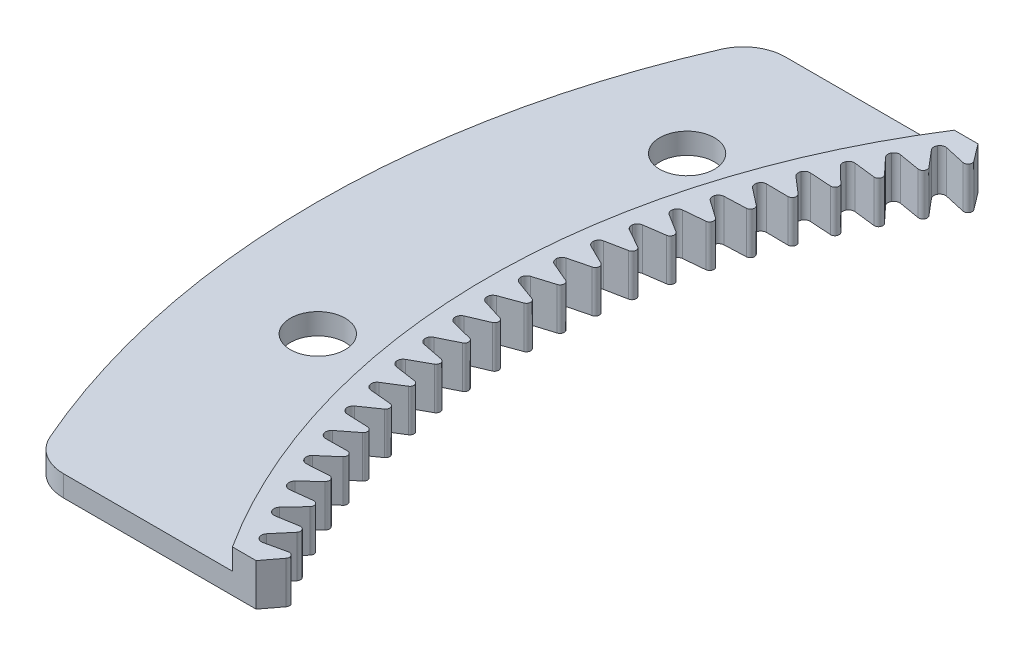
from build123d import *

# Parameters (mm, degrees)
SALIENTE_EXTRUIR1_DEPTH = 10
SALIENTE_EXTRUIR3_DEPTH = 5
REDONDEO1_R             = 10
REDONDEO2_R             = 10
CROQUIS5_R              = 6.5
CORTAR_EXTRUIR1_DEPTH   = 5
CROQUIS6_R              = 6.5
CORTAR_EXTRUIR2_DEPTH   = 5


with BuildPart() as part:
    # Croquis1 → Saliente-Extruir1 (new body)
    with BuildSketch(Plane(origin=(0, 0, 0), x_dir=(1, 0, 0), z_dir=(0, 1, 0))):
        with BuildLine():
            Line((-149.655811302, 0.938965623), (-154.427708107, 2.687256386))
            ThreePointArc((-154.427708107, 2.687256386), (-154.720139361, 2.83546584), (-154.969852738, 3.047893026))
            ThreePointArc((-154.969852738, 3.047893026), (-155.252418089, 3.504537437), (-155.341335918, 4.034123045))
            ThreePointArc((-155.341335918, 4.034123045), (-155.059296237, 4.841235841), (-154.359032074, 5.331753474))
            Line((-154.359032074, 5.331753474), (-149.502824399, 6.830008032))
            ThreePointArc((-149.502824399, 6.830008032), (-148.798983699, 7.733659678), (-149.405352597, 8.705407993))
            Line((-149.405352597, 8.705407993), (-154.080074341, 10.699021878))
            ThreePointArc((-154.080074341, 10.699021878), (-154.725714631, 11.25949138), (-154.92256314, 12.091493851))
            ThreePointArc((-154.92256314, 12.091493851), (-154.599011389, 12.882879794), (-153.874231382, 13.33638987))
            Line((-153.874231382, 13.33638987), (-148.946804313, 14.580569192))
            ThreePointArc((-148.946804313, 14.580569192), (-148.197009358, 15.446470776), (-148.752123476, 16.448382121))
            Line((-148.752123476, 16.448382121), (-153.317067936, 18.681944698))
            ThreePointArc((-153.317067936, 18.681944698), (-153.932747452, 19.275169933), (-154.086146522, 20.116268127))
            ThreePointArc((-154.086146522, 20.116268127), (-153.721954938, 20.889793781), (-152.974612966, 21.305073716))
            Line((-152.974612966, 21.305073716), (-147.989249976, 22.291823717))
            ThreePointArc((-147.989249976, 22.291823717), (-147.19552208, 23.117640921), (-147.697884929, 24.14701432))
            Line((-147.697884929, 24.14701432), (-152.140745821, 26.614504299))
            ThreePointArc((-152.140745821, 26.614504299), (-152.724804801, 27.238886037), (-152.834340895, 28.086812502))
            ThreePointArc((-152.834340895, 28.086812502), (-152.430491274, 28.840392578), (-151.662602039, 29.21632285))
            Line((-151.662602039, 29.21632285), (-146.632742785, 29.942983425))
            ThreePointArc((-146.632742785, 29.942983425), (-145.797221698, 30.726489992), (-146.245478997, 31.780550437))
            Line((-146.245478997, 31.780550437), (-150.554279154, 34.475315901))
            ThreePointArc((-150.554279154, 34.475315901), (-151.105143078, 35.129170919), (-151.170520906, 35.981639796))
            ThreePointArc((-151.170520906, 35.981639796), (-150.728101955, 36.713242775), (-149.94173555, 37.048809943))
            Line((-149.94173555, 37.048809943), (-144.880939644, 37.513422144))
            ThreePointArc((-144.880939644, 37.513422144), (-144.005877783, 38.252505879), (-144.398821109, 39.328411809))
            Line((-144.398821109, 39.328411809), (-148.561944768, 42.243188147))
            ThreePointArc((-148.561944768, 42.243188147), (-149.078128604, 42.924753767), (-149.099171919, 43.77946695))
            ThreePointArc((-149.099171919, 43.77946695), (-148.619376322, 44.487120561), (-147.816652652, 44.781419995))
            Line((-147.816652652, 44.781419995), (-142.738563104, 44.982731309))
            ThreePointArc((-142.738563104, 44.982731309), (-141.826319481, 45.675399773), (-142.162889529, 46.770250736))
            Line((-142.162889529, 46.770250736), (-146.169113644, 49.897180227))
            ThreePointArc((-146.169113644, 49.897180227), (-146.649225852, 50.604619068), (-146.625877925, 51.459272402))
            ThreePointArc((-146.625877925, 51.459272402), (-146.109999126, 52.141068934), (-145.293082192, 52.393307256))
            Line((-145.293082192, 52.393307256), (-140.211388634, 52.330774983))
            ThreePointArc((-140.211388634, 52.330774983), (-139.264422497, 52.975160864), (-139.543711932, 54.086005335))
            Line((-139.543711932, 54.086005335), (-143.382236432, 57.41665833))
            ThreePointArc((-143.382236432, 57.41665833), (-143.824982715, 58.148063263), (-143.757306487, 59.000352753))
            ThreePointArc((-143.757306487, 59.000352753), (-143.206735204, 59.654454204), (-142.37782727, 59.863951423))
            Line((-142.37782727, 59.863951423), (-137.306229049, 59.53774414))
            ThreePointArc((-137.306229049, 59.53774414), (-136.327093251, 60.132110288), (-136.54834916, 61.255953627))
            Line((-136.54834916, 61.255953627), (-140.208826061, 64.781351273))
            ThreePointArc((-140.208826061, 64.781351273), (-140.613012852, 65.534750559), (-140.501190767, 66.382378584))
            ThreePointArc((-140.501190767, 66.382378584), (-139.917411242, 67.007021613), (-139.078746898, 67.173212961))
            Line((-139.078746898, 67.173212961), (-134.030916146, 66.584210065))
            ThreePointArc((-134.030916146, 66.584210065), (-133.022250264, 67.126954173), (-133.184876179, 68.260766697))
            Line((-133.184876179, 68.260766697), (-136.657437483, 71.971405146))
            ThreePointArc((-136.657437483, 71.971405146), (-137.021975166, 72.744767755), (-136.866308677, 73.585449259))
            ThreePointArc((-136.866308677, 73.585449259), (-136.250894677, 74.178949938), (-135.404734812, 74.301387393))
            Line((-135.404734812, 74.301387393), (-130.39427959, 73.451176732))
            ThreePointArc((-130.39427959, 73.451176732), (-129.358802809, 73.940835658), (-129.462360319, 75.081560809))
            Line((-129.462360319, 75.081560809), (-132.737644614, 78.967436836))
            ThreePointArc((-132.737644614, 78.967436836), (-133.061550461, 79.758677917), (-132.862459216, 80.590146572))
            ThreePointArc((-132.862459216, 80.590146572), (-132.217069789, 81.150904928), (-131.365695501, 81.229258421))
            Line((-131.365695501, 81.229258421), (-126.406123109, 80.120132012))
            ThreePointArc((-126.406123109, 80.120132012), (-125.346626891, 80.555385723), (-125.390836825, 81.699948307))
            Line((-125.390836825, 81.699948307), (-128.460014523, 85.750586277))
            Line((-128.460014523, 85.750586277), (-134.088577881, 85.750586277))
            ThreePointArc((-134.088577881, 85.750586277), (-159.163154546, 0), (-134.088577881, -85.750586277))
            Line((-134.088577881, -85.750586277), (-128.460014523, -85.750586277))
            Line((-128.460014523, -85.750586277), (-125.390836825, -81.699948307))
            ThreePointArc((-125.390836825, -81.699948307), (-125.346626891, -80.555385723), (-126.406123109, -80.120132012))
            Line((-126.406123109, -80.120132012), (-131.365695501, -81.229258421))
            ThreePointArc((-131.365695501, -81.229258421), (-132.217069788, -81.150904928), (-132.862459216, -80.590146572))
            ThreePointArc((-132.862459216, -80.590146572), (-133.061550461, -79.758677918), (-132.737644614, -78.967436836))
            Line((-132.737644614, -78.967436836), (-129.462360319, -75.081560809))
            ThreePointArc((-129.462360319, -75.081560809), (-129.358802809, -73.940835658), (-130.39427959, -73.451176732))
            Line((-130.39427959, -73.451176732), (-135.404734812, -74.301387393))
            ThreePointArc((-135.404734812, -74.301387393), (-136.250894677, -74.178949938), (-136.866308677, -73.585449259))
            ThreePointArc((-136.866308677, -73.585449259), (-137.021975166, -72.744767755), (-136.657437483, -71.971405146))
            Line((-136.657437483, -71.971405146), (-133.184876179, -68.260766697))
            ThreePointArc((-133.184876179, -68.260766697), (-133.022250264, -67.126954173), (-134.030916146, -66.584210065))
            Line((-134.030916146, -66.584210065), (-139.078746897, -67.173212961))
            ThreePointArc((-139.078746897, -67.173212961), (-139.917411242, -67.007021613), (-140.501190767, -66.382378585))
            ThreePointArc((-140.501190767, -66.382378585), (-140.613012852, -65.53475056), (-140.208826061, -64.781351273))
            Line((-140.208826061, -64.781351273), (-136.54834916, -61.255953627))
            ThreePointArc((-136.54834916, -61.255953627), (-136.327093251, -60.132110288), (-137.306229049, -59.53774414))
            Line((-137.306229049, -59.53774414), (-142.37782727, -59.863951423))
            ThreePointArc((-142.37782727, -59.863951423), (-143.206735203, -59.654454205), (-143.757306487, -59.000352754))
            ThreePointArc((-143.757306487, -59.000352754), (-143.824982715, -58.148063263), (-143.382236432, -57.41665833))
            Line((-143.382236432, -57.41665833), (-139.543711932, -54.086005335))
            ThreePointArc((-139.543711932, -54.086005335), (-139.264422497, -52.975160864), (-140.211388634, -52.330774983))
            Line((-140.211388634, -52.330774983), (-145.293082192, -52.393307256))
            ThreePointArc((-145.293082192, -52.393307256), (-146.109999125, -52.141068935), (-146.625877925, -51.459272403))
            ThreePointArc((-146.625877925, -51.459272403), (-146.649225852, -50.604619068), (-146.169113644, -49.897180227))
            Line((-146.169113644, -49.897180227), (-142.162889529, -46.770250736))
            ThreePointArc((-142.162889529, -46.770250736), (-141.826319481, -45.675399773), (-142.738563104, -44.982731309))
            Line((-142.738563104, -44.982731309), (-147.816652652, -44.781419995))
            ThreePointArc((-147.816652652, -44.781419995), (-148.619376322, -44.487120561), (-149.099171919, -43.779466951))
            ThreePointArc((-149.099171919, -43.779466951), (-149.078128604, -42.924753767), (-148.561944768, -42.243188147))
            Line((-148.561944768, -42.243188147), (-144.398821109, -39.328411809))
            ThreePointArc((-144.398821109, -39.328411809), (-144.005877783, -38.252505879), (-144.880939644, -37.513422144))
            Line((-144.880939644, -37.513422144), (-149.94173555, -37.048809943))
            ThreePointArc((-149.94173555, -37.048809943), (-150.728101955, -36.713242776), (-151.170520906, -35.981639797))
            ThreePointArc((-151.170520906, -35.981639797), (-151.105143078, -35.129170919), (-150.554279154, -34.475315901))
            Line((-150.554279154, -34.475315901), (-146.245478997, -31.780550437))
            ThreePointArc((-146.245478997, -31.780550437), (-145.797221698, -30.726489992), (-146.632742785, -29.942983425))
            Line((-146.632742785, -29.942983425), (-151.662602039, -29.21632285))
            ThreePointArc((-151.662602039, -29.21632285), (-152.430491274, -28.840392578), (-152.834340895, -28.086812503))
            ThreePointArc((-152.834340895, -28.086812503), (-152.724804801, -27.238886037), (-152.140745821, -26.614504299))
            Line((-152.140745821, -26.614504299), (-147.697884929, -24.14701432))
            ThreePointArc((-147.697884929, -24.14701432), (-147.19552208, -23.117640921), (-147.989249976, -22.291823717))
            Line((-147.989249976, -22.291823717), (-152.974612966, -21.305073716))
            ThreePointArc((-152.974612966, -21.305073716), (-153.721954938, -20.889793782), (-154.086146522, -20.116268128))
            ThreePointArc((-154.086146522, -20.116268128), (-153.932747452, -19.275169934), (-153.317067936, -18.681944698))
            Line((-153.317067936, -18.681944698), (-148.752123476, -16.448382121))
            ThreePointArc((-148.752123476, -16.448382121), (-148.197009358, -15.446470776), (-148.946804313, -14.580569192))
            Line((-148.946804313, -14.580569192), (-153.874231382, -13.33638987))
            ThreePointArc((-153.874231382, -13.33638987), (-154.599011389, -12.882879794), (-154.92256314, -12.091493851))
            ThreePointArc((-154.92256314, -12.091493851), (-154.725714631, -11.25949138), (-154.080074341, -10.699021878))
            Line((-154.080074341, -10.699021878), (-149.405352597, -8.705407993))
            ThreePointArc((-149.405352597, -8.705407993), (-148.798983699, -7.733659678), (-149.502824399, -6.830008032))
            Line((-149.502824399, -6.830008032), (-154.359032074, -5.331753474))
            ThreePointArc((-154.359032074, -5.331753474), (-155.059296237, -4.841235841), (-155.341335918, -4.034123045))
            ThreePointArc((-155.341335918, -4.034123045), (-155.101568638, -3.213459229), (-154.427708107, -2.687256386))
            Line((-154.427708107, -2.687256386), (-149.655811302, -0.938965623))
            ThreePointArc((-149.655811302, -0.938965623), (-148.999822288, 0), (-149.655811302, 0.938965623))
        make_face()
    extrude(amount=SALIENTE_EXTRUIR1_DEPTH)

    # Croquis4 → Saliente-Extruir3 (add)
    with BuildSketch(Plane.XZ):
        with BuildLine():
            Line((-134.088577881, 85.750586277), (-180.684357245, 85.750586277))
            ThreePointArc((-180.684357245, 85.750586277), (-200, 0), (-180.684357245, -85.750586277))
            Line((-180.684357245, -85.750586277), (-134.088577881, -85.750586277))
            ThreePointArc((-134.088577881, -85.750586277), (-159.163154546, 0), (-134.088577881, 85.750586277))
        make_face()
    extrude(amount=-SALIENTE_EXTRUIR3_DEPTH)

    # Redondeo1
    redondeo1_edges = [part.edges().sort_by_distance(p)[0] for p in [
        (-180.684357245, 2.5, 85.750586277),
    ]]
    fillet(redondeo1_edges, radius=REDONDEO1_R)

    # Redondeo2
    redondeo2_edges = [part.edges().sort_by_distance(p)[0] for p in [
        (-180.684357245, 2.5, -85.750586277),
    ]]
    fillet(redondeo2_edges, radius=REDONDEO2_R)

    # Croquis5 → Cortar-Extruir1 (cut)
    with BuildSketch(Plane(origin=(0, 5, 0), x_dir=(1, 0, 0), z_dir=(0, 1, 0))):
        with Locations(Location((-166.03644912, 54.213606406, 0), (0, 0, 270))):
            Circle(CROQUIS5_R)
    extrude(amount=-CORTAR_EXTRUIR1_DEPTH, mode=Mode.SUBTRACT)

    # Croquis6 → Cortar-Extruir2 (cut)
    with BuildSketch(Plane(origin=(0, 5, 0), x_dir=(1, 0, 0), z_dir=(0, 1, 0))):
        with Locations(Location((-172.767956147, -26.786393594, 0), (0, 0, 270))):
            Circle(CROQUIS6_R)
    extrude(amount=-CORTAR_EXTRUIR2_DEPTH, mode=Mode.SUBTRACT)


solid = part.part
